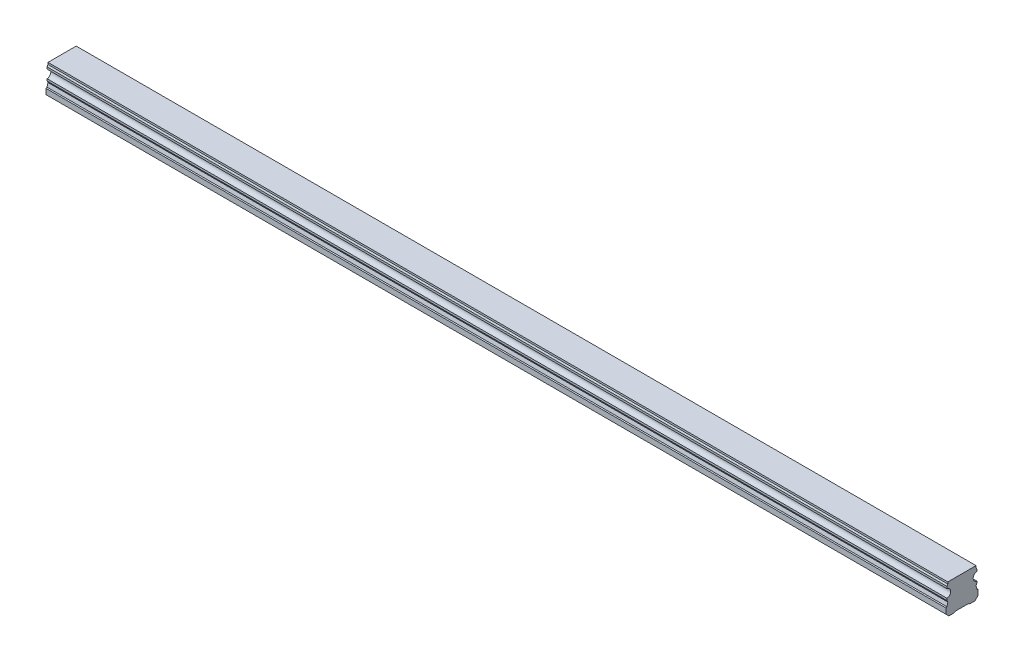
from build123d import *

# Parameters (mm, degrees)
BOSS_EXTRUDE1_DEPTH        = 420
SKETCH3_R                  = 2.5
SKETCH3_R_2                = 2.1
CUT_EXTRUDE3_DEPTH         = 7
SKETCH3_2_R                = 2.1
CUT_EXTRUDE4_DEPTH         = 9.5
CHAMFER1_SIZE              = 0.4
LPATTERN2_COUNT            = 7
LPATTERN2_PITCH            = 60
CHAMFER1_OF_LPATTERN2_SIZE = 0.4


with BuildPart() as part:
    # Sketch1 → Boss-Extrude1 (new body)
    with BuildSketch(Plane(origin=(0, 0, 0), x_dir=(0, 0, -1), z_dir=(1, 0, 0))):
        with BuildLine():
            Line((6.59, 14), (-6.59, 14))
            Line((-6.59, 14), (-6.59, 13.15))
            Line((-6.59, 13.15), (-6.96, 12.356532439))
            Line((-6.96, 12.356532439), (-6.96, 11.435174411))
            ThreePointArc((-6.96, 11.435174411), (-5.25, 9.5), (-6.96, 7.564825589))
            Line((-6.96, 7.564825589), (-6.96, 6.643467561))
            Line((-6.96, 6.643467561), (-6.59, 5.85))
            Line((-6.59, 5.85), (-7.032116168, 4.2))
            Line((-7.032116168, 4.2), (-7.5, 3.929867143))
            Line((-7.5, 3.929867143), (-7.5, 1.4))
            Line((-7.5, 1.4), (-6.1, 0))
            Line((-6.1, 0), (-3.65, 0))
            Line((-3.65, 0), (-3.25, 0.4))
            Line((-3.25, 0.4), (3.25, 0.4))
            Line((3.25, 0.4), (3.65, 0))
            Line((3.65, 0), (6.1, 0))
            Line((6.1, 0), (7.5, 1.4))
            Line((7.5, 1.4), (7.5, 3.929867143))
            Line((7.5, 3.929867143), (7.032116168, 4.2))
            Line((7.032116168, 4.2), (6.59, 5.85))
            Line((6.59, 5.85), (6.96, 6.643467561))
            Line((6.96, 6.643467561), (6.96, 7.564825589))
            ThreePointArc((6.96, 7.564825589), (5.25, 9.5), (6.96, 11.435174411))
            Line((6.96, 11.435174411), (6.96, 12.356532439))
            Line((6.96, 12.356532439), (6.59, 13.15))
            Line((6.59, 13.15), (6.59, 14))
        make_face()
    extrude(amount=BOSS_EXTRUDE1_DEPTH)

    # Sketch3 → Cut-Extrude3 (cut)
    with BuildSketch(Plane.XZ):
        with Locations(Location((30, 0, 0), (0, 0, 270))):
            Circle(SKETCH3_R)
        with Locations(Location((30, 0, 0), (0, 0, 270))):
            Circle(SKETCH3_R_2, mode=Mode.SUBTRACT)
    cut_extrude3 = extrude(amount=-CUT_EXTRUDE3_DEPTH, mode=Mode.SUBTRACT)

    # Sketch3_2 → Cut-Extrude4 (cut)
    with BuildSketch(Plane.XZ):
        with Locations(Location((30, 0, 0), (0, 0, 270))):
            Circle(SKETCH3_2_R)
    cut_extrude4 = extrude(amount=-CUT_EXTRUDE4_DEPTH, mode=Mode.SUBTRACT)

    # Cut-Extrude5 cone 1 section (on through the dimple's axis) → Cut-Extrude5 (revolve, cut)
    with BuildSketch(Plane(origin=(30, 9.5, 0), x_dir=(0, 0, -1), z_dir=(1, 0, 0))):
        Polygon((0, 0), (2.1, 0), (0, 1.212435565), align=None)
    revolve(axis=Axis((30, 9.5, 0), (0, 1, 0)), mode=Mode.SUBTRACT)

    # Chamfer1
    chamfer1_edges = [part.edges().sort_by_distance(p)[0] for p in [
        (30, 0.4, 2.5),
    ]]
    chamfer(chamfer1_edges, length=CHAMFER1_SIZE)

    # LPattern2: Cut-Extrude3, Cut-Extrude4 ×7
    with Locations(*[(i * LPATTERN2_PITCH, 0, 0) for i in range(1, LPATTERN2_COUNT)]):
        add(cut_extrude3, mode=Mode.SUBTRACT)
        add(cut_extrude4, mode=Mode.SUBTRACT)

    # Chamfer1 of LPattern2
    chamfer1_of_lpattern2_edges = [part.edges().sort_by_distance(p)[0] for p in [
        (90, 0.4, 2.5),
        (150, 0.4, 2.5),
        (210, 0.4, 2.5),
        (270, 0.4, 2.5),
        (330, 0.4, 2.5),
        (390, 0.4, 2.5),
    ]]
    chamfer(chamfer1_of_lpattern2_edges, length=CHAMFER1_OF_LPATTERN2_SIZE)


solid = part.part
